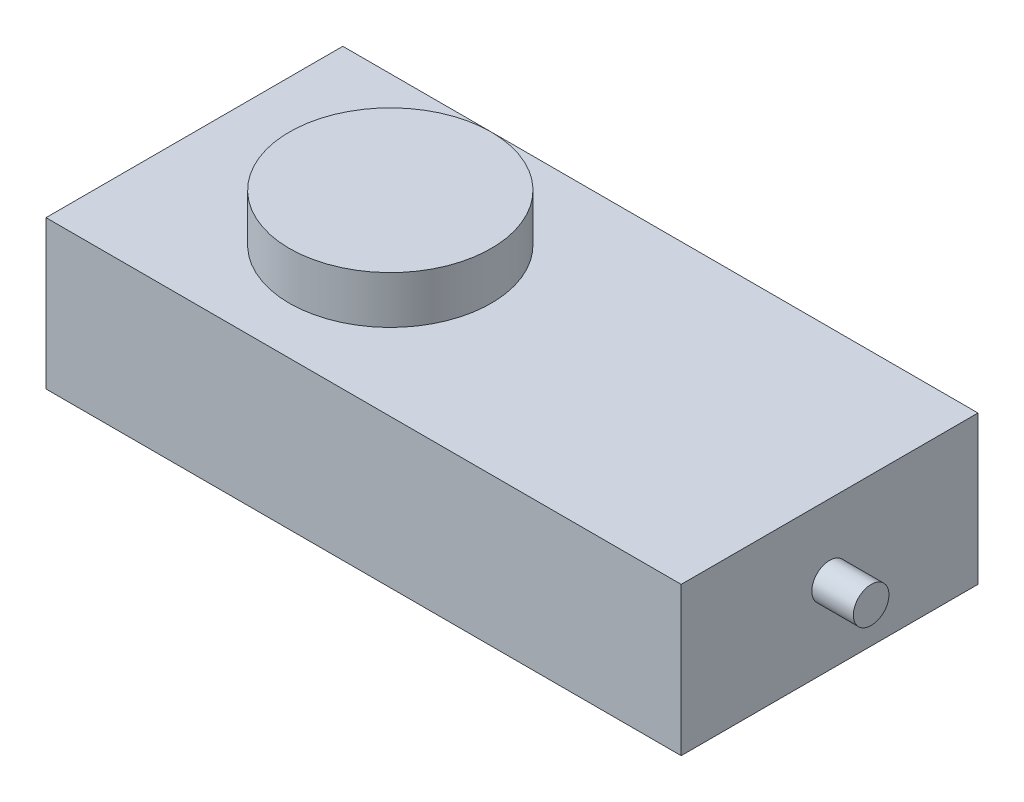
ISO-10303-21;
HEADER;
FILE_DESCRIPTION(('STEP AP214'),'2;1');
FILE_NAME('part.step','',(''),(''),'','','');
FILE_SCHEMA(('AUTOMOTIVE_DESIGN { 1 0 10303 214 1 1 1 1 }'));
ENDSEC;
DATA;
#1=APPLICATION_CONTEXT('core data for automotive mechanical design processes');
#2=APPLICATION_PROTOCOL_DEFINITION('international standard','automotive_design',2000,#1);
#3=PRODUCT_CONTEXT('',#1,'mechanical');
#4=PRODUCT('Part','Part','',(#3));
#5=PRODUCT_RELATED_PRODUCT_CATEGORY('part','',(#4));
#6=PRODUCT_DEFINITION_FORMATION('','',#4);
#7=PRODUCT_DEFINITION_CONTEXT('part definition',#1,'design');
#8=PRODUCT_DEFINITION('design','',#6,#7);
#9=PRODUCT_DEFINITION_SHAPE('','',#8);
#10=(LENGTH_UNIT() NAMED_UNIT(*) SI_UNIT(.MILLI.,.METRE.));
#11=(NAMED_UNIT(*) PLANE_ANGLE_UNIT() SI_UNIT($,.RADIAN.));
#12=(NAMED_UNIT(*) SI_UNIT($,.STERADIAN.) SOLID_ANGLE_UNIT());
#13=UNCERTAINTY_MEASURE_WITH_UNIT(LENGTH_MEASURE(1.E-05),#10,'distance_accuracy_value','');
#14=(GEOMETRIC_REPRESENTATION_CONTEXT(3) GLOBAL_UNCERTAINTY_ASSIGNED_CONTEXT((#13)) GLOBAL_UNIT_ASSIGNED_CONTEXT((#10,
#11,#12)) REPRESENTATION_CONTEXT('',''));
#15=CARTESIAN_POINT('',(0.,0.,0.));
#16=DIRECTION('',(0.,0.,1.));
#17=DIRECTION('',(1.,0.,0.));
#18=AXIS2_PLACEMENT_3D('',#15,#16,#17);
#19=CARTESIAN_POINT('',(-53.5,25.,25.));
#20=DIRECTION('',(1.,0.,0.));
#21=DIRECTION('',(0.,0.,-1.));
#22=AXIS2_PLACEMENT_3D('',#19,#20,#21);
#23=PLANE('',#22);
#24=DIRECTION('',(0.,0.,1.));
#25=VECTOR('',#24,1.);
#26=CARTESIAN_POINT('',(-53.5,0.,25.));
#27=LINE('',#26,#25);
#28=CARTESIAN_POINT('',(-53.5,0.,-25.));
#29=VERTEX_POINT('',#28);
#30=CARTESIAN_POINT('',(-53.5,0.,25.));
#31=VERTEX_POINT('',#30);
#32=EDGE_CURVE('E102',#29,#31,#27,.T.);
#33=ORIENTED_EDGE('',*,*,#32,.T.);
#34=DIRECTION('',(0.,-1.,0.));
#35=VECTOR('',#34,1.);
#36=CARTESIAN_POINT('',(-53.5,25.,25.));
#37=LINE('',#36,#35);
#38=CARTESIAN_POINT('',(-53.5,25.,25.));
#39=VERTEX_POINT('',#38);
#40=EDGE_CURVE('E44',#39,#31,#37,.T.);
#41=ORIENTED_EDGE('',*,*,#40,.F.);
#42=DIRECTION('',(0.,0.,1.));
#43=VECTOR('',#42,1.);
#44=CARTESIAN_POINT('',(-53.5,25.,25.));
#45=LINE('',#44,#43);
#46=CARTESIAN_POINT('',(-53.5,25.,-25.));
#47=VERTEX_POINT('',#46);
#48=EDGE_CURVE('E88',#47,#39,#45,.T.);
#49=ORIENTED_EDGE('',*,*,#48,.F.);
#50=DIRECTION('',(0.,-1.,0.));
#51=VECTOR('',#50,1.);
#52=CARTESIAN_POINT('',(-53.5,25.,-25.));
#53=LINE('',#52,#51);
#54=EDGE_CURVE('E98',#47,#29,#53,.T.);
#55=ORIENTED_EDGE('',*,*,#54,.T.);
#56=EDGE_LOOP('',(#33,#41,#49,#55));
#57=FACE_BOUND('',#56,.T.);
#58=ADVANCED_FACE('F36',(#57),#23,.F.);
#59=CARTESIAN_POINT('',(53.5,25.,25.));
#60=DIRECTION('',(0.,0.,-1.));
#61=DIRECTION('',(-1.,0.,0.));
#62=AXIS2_PLACEMENT_3D('',#59,#60,#61);
#63=PLANE('',#62);
#64=DIRECTION('',(1.,0.,0.));
#65=VECTOR('',#64,1.);
#66=CARTESIAN_POINT('',(53.5,0.,25.));
#67=LINE('',#66,#65);
#68=CARTESIAN_POINT('',(53.5,0.,25.));
#69=VERTEX_POINT('',#68);
#70=EDGE_CURVE('E93',#31,#69,#67,.T.);
#71=ORIENTED_EDGE('',*,*,#70,.T.);
#72=DIRECTION('',(0.,-1.,0.));
#73=VECTOR('',#72,1.);
#74=CARTESIAN_POINT('',(53.5,25.,25.));
#75=LINE('',#74,#73);
#76=CARTESIAN_POINT('',(53.5,25.,25.));
#77=VERTEX_POINT('',#76);
#78=EDGE_CURVE('E91',#77,#69,#75,.T.);
#79=ORIENTED_EDGE('',*,*,#78,.F.);
#80=DIRECTION('',(1.,0.,0.));
#81=VECTOR('',#80,1.);
#82=CARTESIAN_POINT('',(53.5,25.,25.));
#83=LINE('',#82,#81);
#84=EDGE_CURVE('E83',#39,#77,#83,.T.);
#85=ORIENTED_EDGE('',*,*,#84,.F.);
#86=ORIENTED_EDGE('',*,*,#40,.T.);
#87=EDGE_LOOP('',(#71,#79,#85,#86));
#88=FACE_BOUND('',#87,.T.);
#89=ADVANCED_FACE('F92',(#88),#63,.F.);
#90=CARTESIAN_POINT('',(53.5,25.,25.));
#91=DIRECTION('',(-1.,0.,0.));
#92=DIRECTION('',(0.,0.,1.));
#93=AXIS2_PLACEMENT_3D('',#90,#91,#92);
#94=PLANE('',#93);
#95=CARTESIAN_POINT('',(53.5,13.,0.));
#96=DIRECTION('',(-1.,0.,0.));
#97=DIRECTION('',(0.,0.,1.));
#98=AXIS2_PLACEMENT_3D('',#95,#96,#97);
#99=CIRCLE('',#98,3.);
#100=CARTESIAN_POINT('',(53.5,13.,3.00000000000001));
#101=VERTEX_POINT('',#100);
#102=EDGE_CURVE('E11',#101,#101,#99,.F.);
#103=ORIENTED_EDGE('',*,*,#102,.F.);
#104=EDGE_LOOP('',(#103));
#105=FACE_BOUND('',#104,.T.);
#106=DIRECTION('',(0.,0.,-1.));
#107=VECTOR('',#106,1.);
#108=CARTESIAN_POINT('',(53.5,0.,25.));
#109=LINE('',#108,#107);
#110=CARTESIAN_POINT('',(53.5,0.,-25.));
#111=VERTEX_POINT('',#110);
#112=EDGE_CURVE('E69',#69,#111,#109,.T.);
#113=ORIENTED_EDGE('',*,*,#112,.T.);
#114=DIRECTION('',(0.,-1.,0.));
#115=VECTOR('',#114,1.);
#116=CARTESIAN_POINT('',(53.5,25.,-25.));
#117=LINE('',#116,#115);
#118=CARTESIAN_POINT('',(53.5,25.,-25.));
#119=VERTEX_POINT('',#118);
#120=EDGE_CURVE('E94',#119,#111,#117,.T.);
#121=ORIENTED_EDGE('',*,*,#120,.F.);
#122=DIRECTION('',(0.,0.,-1.));
#123=VECTOR('',#122,1.);
#124=CARTESIAN_POINT('',(53.5,25.,25.));
#125=LINE('',#124,#123);
#126=EDGE_CURVE('E86',#77,#119,#125,.T.);
#127=ORIENTED_EDGE('',*,*,#126,.F.);
#128=ORIENTED_EDGE('',*,*,#78,.T.);
#129=EDGE_LOOP('',(#113,#121,#127,#128));
#130=FACE_BOUND('',#129,.T.);
#131=ADVANCED_FACE('F96',(#105,#130),#94,.F.);
#132=CARTESIAN_POINT('',(53.5,25.,-25.));
#133=DIRECTION('',(0.,0.,1.));
#134=DIRECTION('',(1.,0.,0.));
#135=AXIS2_PLACEMENT_3D('',#132,#133,#134);
#136=PLANE('',#135);
#137=DIRECTION('',(-1.,0.,0.));
#138=VECTOR('',#137,1.);
#139=CARTESIAN_POINT('',(53.5,0.,-25.));
#140=LINE('',#139,#138);
#141=EDGE_CURVE('E75',#111,#29,#140,.T.);
#142=ORIENTED_EDGE('',*,*,#141,.T.);
#143=ORIENTED_EDGE('',*,*,#54,.F.);
#144=DIRECTION('',(-1.,0.,0.));
#145=VECTOR('',#144,1.);
#146=CARTESIAN_POINT('',(53.5,25.,-25.));
#147=LINE('',#146,#145);
#148=EDGE_CURVE('E52',#119,#47,#147,.T.);
#149=ORIENTED_EDGE('',*,*,#148,.F.);
#150=ORIENTED_EDGE('',*,*,#120,.T.);
#151=EDGE_LOOP('',(#142,#143,#149,#150));
#152=FACE_BOUND('',#151,.T.);
#153=ADVANCED_FACE('F124',(#152),#136,.F.);
#154=CARTESIAN_POINT('',(0.,25.,0.));
#155=DIRECTION('',(0.,1.,0.));
#156=DIRECTION('',(0.,0.,1.));
#157=AXIS2_PLACEMENT_3D('',#154,#155,#156);
#158=PLANE('',#157);
#159=CARTESIAN_POINT('',(-20.5,25.,0.));
#160=DIRECTION('',(0.,1.,0.));
#161=DIRECTION('',(0.,0.,1.));
#162=AXIS2_PLACEMENT_3D('',#159,#160,#161);
#163=CIRCLE('',#162,17.);
#164=CARTESIAN_POINT('',(-20.5,25.,17.));
#165=VERTEX_POINT('',#164);
#166=EDGE_CURVE('E195',#165,#165,#163,.T.);
#167=ORIENTED_EDGE('',*,*,#166,.F.);
#168=EDGE_LOOP('',(#167));
#169=FACE_BOUND('',#168,.T.);
#170=ORIENTED_EDGE('',*,*,#48,.T.);
#171=ORIENTED_EDGE('',*,*,#84,.T.);
#172=ORIENTED_EDGE('',*,*,#126,.T.);
#173=ORIENTED_EDGE('',*,*,#148,.T.);
#174=EDGE_LOOP('',(#170,#171,#172,#173));
#175=FACE_BOUND('',#174,.T.);
#176=ADVANCED_FACE('F84',(#169,#175),#158,.T.);
#177=CARTESIAN_POINT('',(0.,0.,0.));
#178=DIRECTION('',(0.,1.,0.));
#179=DIRECTION('',(0.,0.,1.));
#180=AXIS2_PLACEMENT_3D('',#177,#178,#179);
#181=PLANE('',#180);
#182=ORIENTED_EDGE('',*,*,#32,.F.);
#183=ORIENTED_EDGE('',*,*,#141,.F.);
#184=ORIENTED_EDGE('',*,*,#112,.F.);
#185=ORIENTED_EDGE('',*,*,#70,.F.);
#186=EDGE_LOOP('',(#182,#183,#184,#185));
#187=FACE_BOUND('',#186,.T.);
#188=ADVANCED_FACE('F113',(#187),#181,.F.);
#189=CARTESIAN_POINT('',(-20.5,33.,0.));
#190=DIRECTION('',(0.,-1.,0.));
#191=DIRECTION('',(0.,0.,-1.));
#192=AXIS2_PLACEMENT_3D('',#189,#190,#191);
#193=CYLINDRICAL_SURFACE('',#192,17.);
#194=CARTESIAN_POINT('',(-20.5,33.,0.));
#195=DIRECTION('',(0.,1.,0.));
#196=DIRECTION('',(0.,0.,1.));
#197=AXIS2_PLACEMENT_3D('',#194,#195,#196);
#198=CIRCLE('',#197,17.);
#199=CARTESIAN_POINT('',(-20.5,33.,17.));
#200=VERTEX_POINT('',#199);
#201=EDGE_CURVE('E105',#200,#200,#198,.T.);
#202=ORIENTED_EDGE('',*,*,#201,.F.);
#203=EDGE_LOOP('',(#202));
#204=FACE_BOUND('',#203,.T.);
#205=ORIENTED_EDGE('',*,*,#166,.T.);
#206=EDGE_LOOP('',(#205));
#207=FACE_BOUND('',#206,.T.);
#208=ADVANCED_FACE('F115',(#204,#207),#193,.T.);
#209=CARTESIAN_POINT('',(-20.5,33.,0.));
#210=DIRECTION('',(0.,1.,0.));
#211=DIRECTION('',(0.,0.,1.));
#212=AXIS2_PLACEMENT_3D('',#209,#210,#211);
#213=PLANE('',#212);
#214=ORIENTED_EDGE('',*,*,#201,.T.);
#215=EDGE_LOOP('',(#214));
#216=FACE_BOUND('',#215,.T.);
#217=ADVANCED_FACE('F121',(#216),#213,.T.);
#218=CARTESIAN_POINT('',(60.5,13.,0.));
#219=DIRECTION('',(-1.,0.,0.));
#220=DIRECTION('',(0.,0.,1.));
#221=AXIS2_PLACEMENT_3D('',#218,#219,#220);
#222=CYLINDRICAL_SURFACE('',#221,3.);
#223=CARTESIAN_POINT('',(60.5,13.,0.));
#224=DIRECTION('',(1.,0.,0.));
#225=DIRECTION('',(0.,0.,-1.));
#226=AXIS2_PLACEMENT_3D('',#223,#224,#225);
#227=CIRCLE('',#226,3.);
#228=CARTESIAN_POINT('',(60.5,13.,-2.99999999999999));
#229=VERTEX_POINT('',#228);
#230=EDGE_CURVE('E194',#229,#229,#227,.T.);
#231=ORIENTED_EDGE('',*,*,#230,.F.);
#232=EDGE_LOOP('',(#231));
#233=FACE_BOUND('',#232,.T.);
#234=ORIENTED_EDGE('',*,*,#102,.T.);
#235=EDGE_LOOP('',(#234));
#236=FACE_BOUND('',#235,.T.);
#237=ADVANCED_FACE('F162',(#233,#236),#222,.T.);
#238=CARTESIAN_POINT('',(60.5,13.,0.));
#239=DIRECTION('',(1.,0.,0.));
#240=DIRECTION('',(0.,0.,-1.));
#241=AXIS2_PLACEMENT_3D('',#238,#239,#240);
#242=PLANE('',#241);
#243=ORIENTED_EDGE('',*,*,#230,.T.);
#244=EDGE_LOOP('',(#243));
#245=FACE_BOUND('',#244,.T.);
#246=ADVANCED_FACE('F178',(#245),#242,.T.);
#247=CLOSED_SHELL('',(#58,#89,#131,#153,#176,#188,#208,#217,#237,#246));
#248=MANIFOLD_SOLID_BREP('B2',#247);
#249=ADVANCED_BREP_SHAPE_REPRESENTATION('',(#18,#248),#14);
#250=SHAPE_DEFINITION_REPRESENTATION(#9,#249);
ENDSEC;
END-ISO-10303-21;
